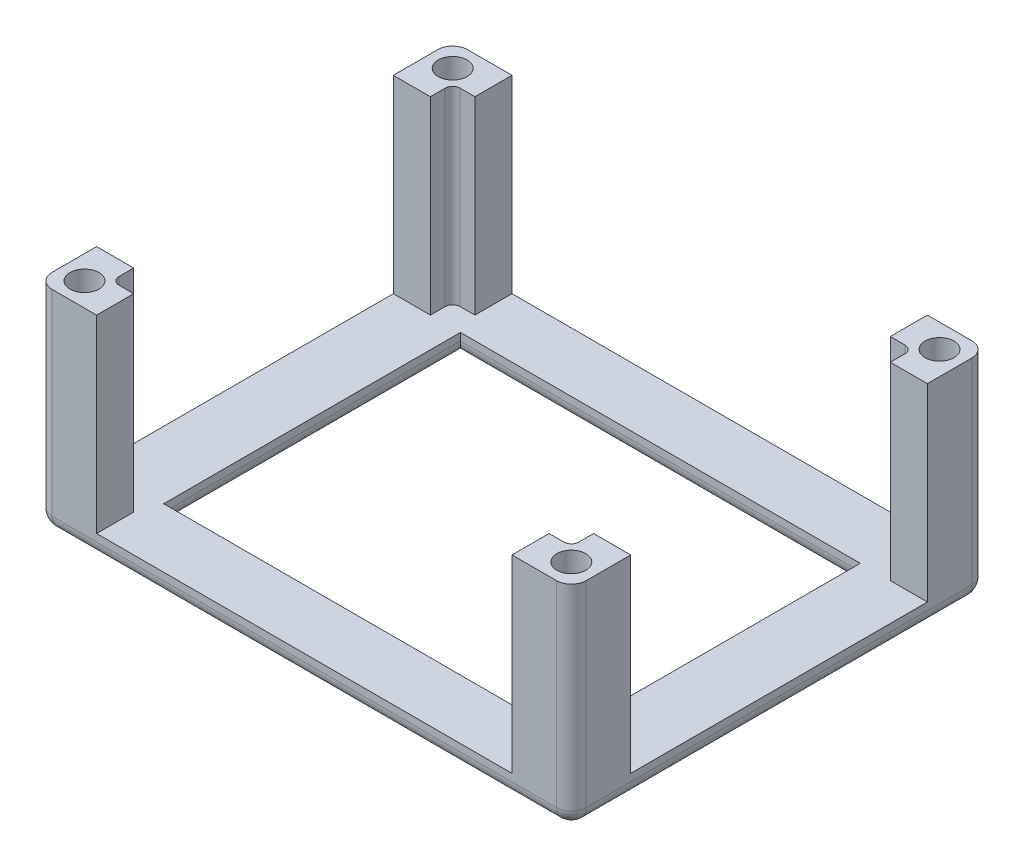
from build123d import *

# Parameters (mm, degrees)
SKETCH_1_W          = 5
SKETCH_1_H          = 5
SKETCH_1_W_2        = 62
SKETCH_1_H_2        = 46
SKETCH_1_W_3        = 53.913043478
SKETCH_1_H_3        = 40
EXTRUDE_1_DEPTH     = 5
SKETCH_1_4_W        = 5
SKETCH_1_4_H        = 5
EXTRUDE_2_DEPTH     = 25.5
SKETCH_2_W          = 5
SKETCH_2_H          = 3
SKETCH_2_W_2        = 3
SKETCH_2_H_2        = 5
EXTRUDE_3_DEPTH     = 25.5
SKETCH_3_R          = 1.95
CUT_EXTRUDE_1_DEPTH = 10
FILLET_1_R          = 1
SKETCH_5_W          = 72
SKETCH_5_H          = 56
CUT_EXTRUDE_2_DEPTH = 2
FILLET_3_R          = 2


with BuildPart() as part:
    # Sketch 1 → Extrude 1 (new body)
    # profile 1 of 9: a face of its own
    with BuildSketch(Plane(origin=(0, 0, 0), x_dir=(1, 0, 0), z_dir=(0, 1, 0))):
        with Locations((-33.5, 25.5)):
            Rectangle(SKETCH_1_W, SKETCH_1_H)
    # profile 2 of 9: a face of its own
    with BuildSketch(Plane(origin=(0, 0, 0), x_dir=(1, 0, 0), z_dir=(0, 1, 0))):
        with Locations((0, 25.5)):
            Rectangle(SKETCH_1_W_2, SKETCH_1_H)
    # profile 3 of 9: a face of its own
    with BuildSketch(Plane(origin=(0, 0, 0), x_dir=(1, 0, 0), z_dir=(0, 1, 0))):
        with Locations((-33.5, 0)):
            Rectangle(SKETCH_1_W, SKETCH_1_H_2)
    # profile 4 of 9: a face of its own
    with BuildSketch(Plane(origin=(0, 0, 0), x_dir=(1, 0, 0), z_dir=(0, 1, 0))):
        with Locations((33.5, 25.5)):
            Rectangle(SKETCH_1_W, SKETCH_1_H)
    # profile 5 of 9: a face of its own
    with BuildSketch(Plane(origin=(0, 0, 0), x_dir=(1, 0, 0), z_dir=(0, 1, 0))):
        Rectangle(SKETCH_1_W_2, SKETCH_1_H_2)
        Rectangle(SKETCH_1_W_3, SKETCH_1_H_3, mode=Mode.SUBTRACT)
    # profile 6 of 9: a face of its own
    with BuildSketch(Plane(origin=(0, 0, 0), x_dir=(1, 0, 0), z_dir=(0, 1, 0))):
        with Locations((-33.5, -25.5)):
            Rectangle(SKETCH_1_W, SKETCH_1_H)
    # profile 7 of 9: a face of its own
    with BuildSketch(Plane(origin=(0, 0, 0), x_dir=(1, 0, 0), z_dir=(0, 1, 0))):
        with Locations((33.5, 0)):
            Rectangle(SKETCH_1_W, SKETCH_1_H_2)
    # profile 8 of 9: a face of its own
    with BuildSketch(Plane(origin=(0, 0, 0), x_dir=(1, 0, 0), z_dir=(0, 1, 0))):
        with Locations((0, -25.5)):
            Rectangle(SKETCH_1_W_2, SKETCH_1_H)
    # profile 9 of 9: a face of its own
    with BuildSketch(Plane(origin=(0, 0, 0), x_dir=(1, 0, 0), z_dir=(0, 1, 0))):
        with Locations((33.5, -25.5)):
            Rectangle(SKETCH_1_W, SKETCH_1_H)
    extrude(amount=-EXTRUDE_1_DEPTH)

    # Sketch 1_4 → Extrude 2 (add)
    with BuildSketch(Plane(origin=(0, 0, 0), x_dir=(1, 0, 0), z_dir=(0, 1, 0))):
        with Locations((33.5, 25.5)):
            Rectangle(SKETCH_1_4_W, SKETCH_1_4_H)
        with Locations((33.5, -25.5)):
            Rectangle(SKETCH_1_4_W, SKETCH_1_4_H)
        with Locations((-33.5, -25.5)):
            Rectangle(SKETCH_1_4_W, SKETCH_1_4_H)
        with Locations((-33.5, 25.5)):
            Rectangle(SKETCH_1_4_W, SKETCH_1_4_H)
    extrude(amount=EXTRUDE_2_DEPTH)

    # Sketch 2 → Extrude 3 (add)
    with BuildSketch(Plane(origin=(0, 25.5, 0), x_dir=(1, 0, 0), z_dir=(0, 1, 0))):
        with Locations((-33.5, 21.5)):
            Rectangle(SKETCH_2_W, SKETCH_2_H)
        with Locations((-29.5, 25.5)):
            Rectangle(SKETCH_2_W_2, SKETCH_2_H_2)
        with Locations((-33.5, -21.5)):
            Rectangle(SKETCH_2_W, SKETCH_2_H)
        with Locations((-29.5, -25.5)):
            Rectangle(SKETCH_2_W_2, SKETCH_2_H_2)
        with Locations((33.5, -21.5)):
            Rectangle(SKETCH_2_W, SKETCH_2_H)
        with Locations((29.5, -25.5)):
            Rectangle(SKETCH_2_W_2, SKETCH_2_H_2)
        with Locations((29.5, 25.5)):
            Rectangle(SKETCH_2_W_2, SKETCH_2_H_2)
        with Locations((33.5, 21.5)):
            Rectangle(SKETCH_2_W, SKETCH_2_H)
    extrude(amount=-EXTRUDE_3_DEPTH)

    # Sketch 3 → Cut-Extrude 1 (cut)
    with BuildSketch(Plane(origin=(0, 25.5, 0), x_dir=(1, 0, 0), z_dir=(0, 1, 0))):
        with Locations(Location((-32.818019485, 24.818019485, 0), (0, 0, 270))):
            Circle(SKETCH_3_R)
        with BuildLine():
            ThreePointArc((-30.868019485, -24.818019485), (-31.016454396, -24.071786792), (-31.439161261, -23.439161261))
            Line((-31.439161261, -23.439161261), (-34.196877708, -26.196877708))
            ThreePointArc((-34.196877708, -26.196877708), (-32.071786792, -26.619584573), (-30.868019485, -24.818019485))
        make_face()
        with BuildLine():
            Line((-34.196877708, -26.196877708), (-31.439161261, -23.439161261))
            ThreePointArc((-31.439161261, -23.439161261), (-34.196877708, -23.439161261), (-34.196877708, -26.196877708))
        make_face()
        with BuildLine():
            ThreePointArc((-30.868019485, -24.818019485), (-31.016454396, -24.071786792), (-31.439161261, -23.439161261))
            Line((-31.439161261, -23.439161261), (-34.196877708, -26.196877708))
            ThreePointArc((-34.196877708, -26.196877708), (-32.071786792, -26.619584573), (-30.868019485, -24.818019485))
        make_face()
        with BuildLine():
            Line((-34.196877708, -26.196877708), (-31.439161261, -23.439161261))
            ThreePointArc((-31.439161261, -23.439161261), (-34.196877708, -23.439161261), (-34.196877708, -26.196877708))
        make_face()
        with Locations(Location((32.818019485, -24.818019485, 0), (0, 0, 270))):
            Circle(SKETCH_3_R)
        with Locations(Location((32.818019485, 24.818019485, 0), (0, 0, 270))):
            Circle(SKETCH_3_R)
    extrude(amount=-CUT_EXTRUDE_1_DEPTH, mode=Mode.SUBTRACT)

    # Fillet 1
    fillet_1_edges = [part.edges().sort_by_distance(p)[0] for p in [
        (-31, 12.75, -23),
        (-31, 12.75, 23),
        (31, 12.75, 23),
        (31, 12.75, -23),
    ]]
    fillet(fillet_1_edges, radius=FILLET_1_R)

    # Sketch 5 → Cut-Extrude 2 (cut)
    with BuildSketch(Plane.XZ.offset(5)):
        Rectangle(SKETCH_5_W, SKETCH_5_H)
    extrude(amount=-CUT_EXTRUDE_2_DEPTH, mode=Mode.SUBTRACT)

    # Fillet 3
    fillet_3_edges = [part.edges().sort_by_distance(p)[0] for p in [
        (-26.956521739, -3, 0),
        (-36, 11.25, 28),
        (36, 11.25, 28),
        (36, 11.25, -28),
        (-36, 11.25, -28),
        (0, -3, -20),
        (36, -3, 0),
        (0, -3, -28),
        (-36, -3, 0),
        (0, -3, 28),
        (0, -3, 20),
        (26.956521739, -3, 0),
    ]]
    fillet(fillet_3_edges, radius=FILLET_3_R)


solid = part.part
